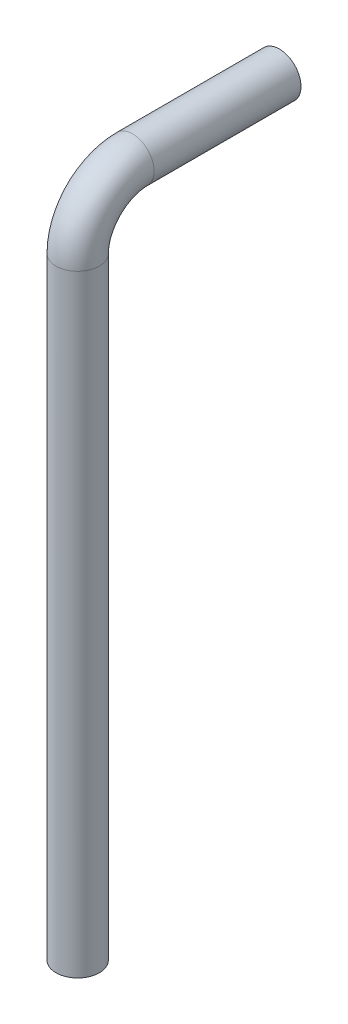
from build123d import *

# Parameters (mm, degrees)
ESQUISSE2_R   = 30.15
ESQUISSE2_R_2 = 28.15


with BuildPart() as part:
    # Balayage1: sweep along a path in Esquisse1
    with BuildLine(Plane(origin=(0, 0, 0), x_dir=(0, 0, -1), z_dir=(1, 0, 0))) as balayage1_path:
        Line((0, 0), (-204, 0))
        ThreePointArc((-204, 0), (-257.74011537, -22.25988463), (-280, -76))
        Line((-280, -76), (-280, -926))
    # Esquisse2 → Balayage1 (sweep)
    with BuildSketch(Plane.XY):
        Circle(ESQUISSE2_R)
        Circle(ESQUISSE2_R_2, mode=Mode.SUBTRACT)
    sweep(path=balayage1_path.line)


solid = part.part
